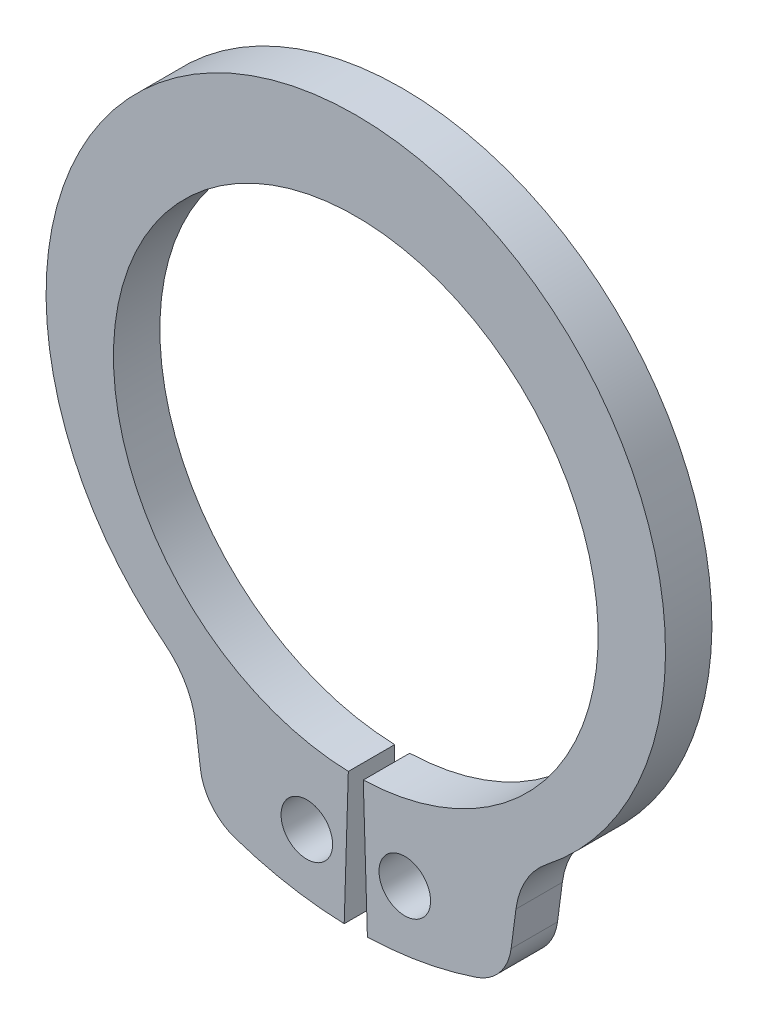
from build123d import *

# Parameters (mm, degrees)
BODYSKE_R  = 0.5
BODY_DEPTH = 0.9


with BuildPart() as part:
    # BodySke → Body (new body)
    with BuildSketch(Plane.XY):
        with BuildLine():
            Line((0.144863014, -4.697766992), (0.225, -7.29653171))
            ThreePointArc((0.225, -7.29653171), (1.297313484, -7.183799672), (2.341325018, -6.914347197))
            ThreePointArc((2.341325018, -6.914347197), (2.793368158, -6.601859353), (3.012040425, -6.09770254))
            Line((3.012040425, -6.09770254), (3.1059434, -5.384438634))
            ThreePointArc((3.1059434, -5.384438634), (3.302423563, -4.800751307), (3.704948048, -4.334629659))
            ThreePointArc((3.704948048, -4.334629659), (0, 6.4), (-3.704948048, -4.334629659))
            ThreePointArc((-3.704948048, -4.334629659), (-3.302423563, -4.800751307), (-3.1059434, -5.384438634))
            Line((-3.1059434, -5.384438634), (-3.012040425, -6.09770254))
            ThreePointArc((-3.012040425, -6.09770254), (-2.793368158, -6.601859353), (-2.341325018, -6.914347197))
            ThreePointArc((-2.341325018, -6.914347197), (-1.297313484, -7.183799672), (-0.225, -7.29653171))
            Line((-0.225, -7.29653171), (-0.144863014, -4.697766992))
            ThreePointArc((-0.144863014, -4.697766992), (0, 4.7), (0.144863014, -4.697766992))
        make_face()
        with Locations((0.95, -6.076183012)):
            Circle(BODYSKE_R, mode=Mode.SUBTRACT)
        with Locations((-0.95, -6.076183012)):
            Circle(BODYSKE_R, mode=Mode.SUBTRACT)
    extrude(amount=-BODY_DEPTH)


solid = part.part
